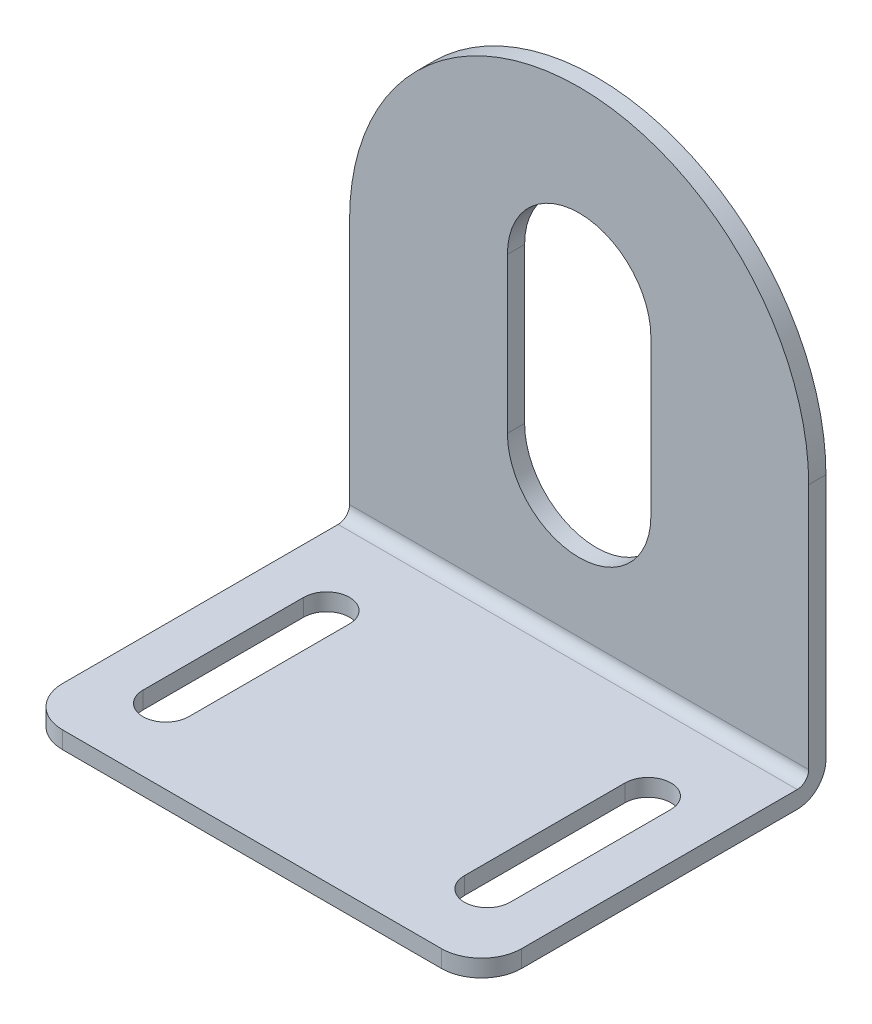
from build123d import *

# Parameters (mm, degrees)
EXTRUDE_THIN1_DEPTH = 20
FILLET1_R           = 2.5
FILLET2_R           = 1
CUT_EXTRUDE2_DEPTH  = 10
CUT_EXTRUDE3_DEPTH  = 10
SKETCH8_W           = 40
SKETCH8_H           = 1.5
CUT_EXTRUDE5_DEPTH  = 1.5
CUT_EXTRUDE6_DEPTH  = 1.5
FILLET3_R           = 3.5


with BuildPart() as part:
    # Sketch3 → Extrude-Thin1 (new, symmetric)
    with BuildSketch(Plane(origin=(0, 0, 0), x_dir=(0, 0, -1), z_dir=(1, 0, 0))):
        Polygon((-30, 0), (0, 0), (0, 42.5), (1.5, 42.5), (1.5, -1.5), (-30, -1.5), align=None)
    extrude(amount=EXTRUDE_THIN1_DEPTH, both=True)

    # Fillet1
    fillet1_edges = [part.edges().sort_by_distance(p)[0] for p in [
        (0, -1.5, -1.5),
    ]]
    fillet(fillet1_edges, radius=FILLET1_R)

    # Fillet2
    fillet2_edges = [part.edges().sort_by_distance(p)[0] for p in [
        (0, 0, 0),
    ]]
    fillet(fillet2_edges, radius=FILLET2_R)

    # Sketch4 → Cut-Extrude2 (cut)
    with BuildSketch(Plane(origin=(0, 0, -1.5), x_dir=(-1, 0, 0), z_dir=(0, 0, -1))):
        with BuildLine():
            Line((-20, 22.5), (-20, 51.864203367))
            Line((-20, 51.864203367), (20, 51.864203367))
            Line((20, 51.864203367), (20, 22.5))
            ThreePointArc((20, 22.5), (0, 42.5), (-20, 22.5))
        make_face()
    extrude(amount=-CUT_EXTRUDE2_DEPTH, mode=Mode.SUBTRACT)

    # Sketch5 → Cut-Extrude3 (cut)
    with BuildSketch(Plane.XY):
        with BuildLine():
            Line((-6.25, 13.25), (-6.25, 26.75))
            ThreePointArc((-6.25, 26.75), (0, 33), (6.25, 26.75))
            Line((6.25, 26.75), (6.25, 13.25))
            ThreePointArc((6.25, 13.25), (0, 7), (-6.25, 13.25))
        make_face()
    extrude(amount=-CUT_EXTRUDE3_DEPTH, mode=Mode.SUBTRACT)

    # Sketch8 → Cut-Extrude5 (cut)
    with BuildSketch(Plane.XY.offset(30)):
        with Locations((0, -0.75)):
            Rectangle(SKETCH8_W, SKETCH8_H)
    extrude(amount=-CUT_EXTRUDE5_DEPTH, mode=Mode.SUBTRACT)

    # Sketch9 → Cut-Extrude6 (cut)
    with BuildSketch(Plane.XZ.offset(1.5)):
        with BuildLine():
            Line((-12, 22), (-12, 8))
            ThreePointArc((-12, 8), (-14, 6), (-16, 8))
            Line((-16, 8), (-16, 22))
            ThreePointArc((-16, 22), (-14, 24), (-12, 22))
        make_face()
        with BuildLine():
            Line((12, 22), (12, 8))
            ThreePointArc((12, 8), (14, 6), (16, 8))
            Line((16, 8), (16, 22))
            ThreePointArc((16, 22), (14, 24), (12, 22))
        make_face()
    extrude(amount=-CUT_EXTRUDE6_DEPTH, mode=Mode.SUBTRACT)

    # Fillet3
    fillet3_edges = [part.edges().sort_by_distance(p)[0] for p in [
        (-20, -0.75, 28.5),
        (20, -0.75, 28.5),
    ]]
    fillet(fillet3_edges, radius=FILLET3_R)


solid = part.part
